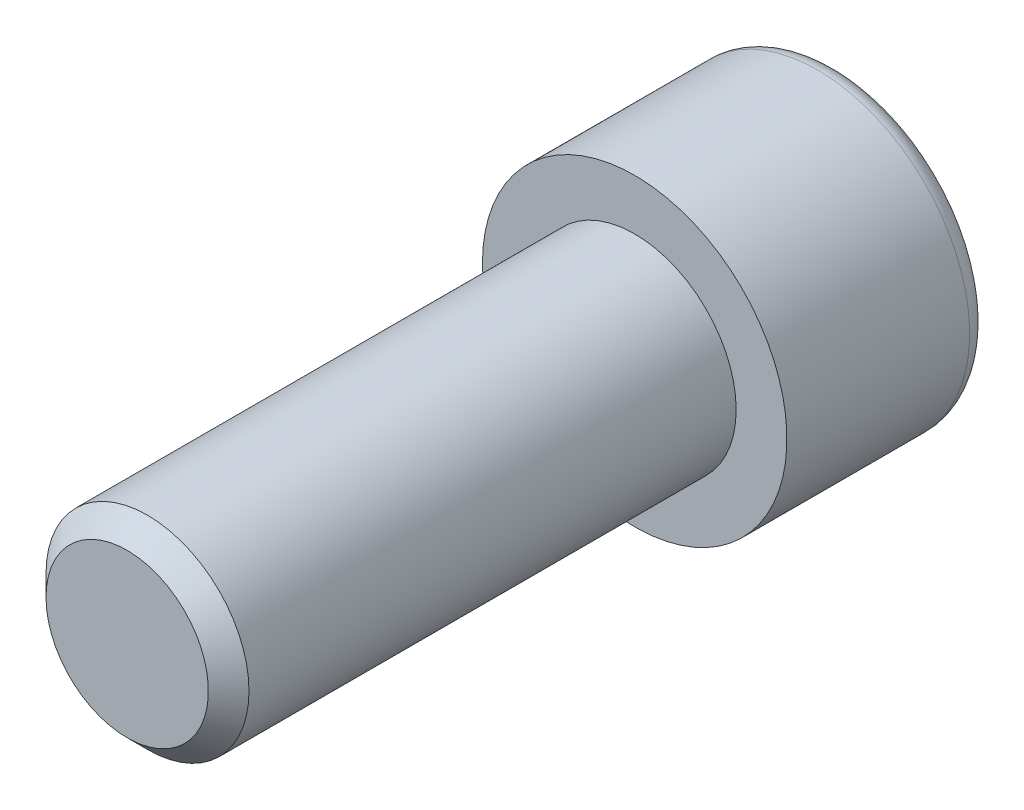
from build123d import *

# Parameters (mm, degrees)
ENLEV_MAT_EXTRU1_DEPTH = 6
ESQUISSE3_W            = 6
ESQUISSE3_H            = 30
CHANFREIN1_SIZE        = 1.2


with BuildPart() as part:
    # Esquisse1 → Base-R_volution (revolve)
    with BuildSketch(Plane(origin=(0, 0, 0), x_dir=(1, 0, 0), z_dir=(0, 1, 0)), mode=Mode.PRIVATE) as base_r_volution_sk:
        with BuildLine():
            Line((0, 0), (9, 0))
            Line((9, 0), (9, 10.8))
            ThreePointArc((9, 10.8), (8.648528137, 11.648528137), (7.8, 12))
            Line((7.8, 12), (0, 12))
            Line((0, 12), (0, 0))
        make_face()
    revolve(base_r_volution_sk.sketch.rotate(Axis((0, 0, 0), (0, 0, -1)), 180), axis=Axis((0, 0, 0), (0, 0, -1)))

    # Esquisse2 → enlev-mat-Extru1 (cut)
    with BuildSketch(Plane.XY.offset(-12)):
        Polygon((5, -2.886751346), (5, 2.886751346), (0, 5.773502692), (-5, 2.886751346), (-5, -2.886751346), (0, -5.773502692), align=None)
    extrude(amount=ENLEV_MAT_EXTRU1_DEPTH, mode=Mode.SUBTRACT)

    # Esquisse3 → Boss.-R_vol.1 (revolve)
    with BuildSketch(Plane(origin=(0, 0, 0), x_dir=(1, 0, 0), z_dir=(0, 1, 0))):
        with Locations((3, -15)):
            Rectangle(ESQUISSE3_W, ESQUISSE3_H)
    revolve(axis=Axis((0, 0, 0), (0, 0, 1)))

    # Chanfrein1
    chanfrein1_edges = [part.edges().sort_by_distance(p)[0] for p in [
        (-6, 0, 30),
    ]]
    chamfer(chanfrein1_edges, length=CHANFREIN1_SIZE)


solid = part.part
